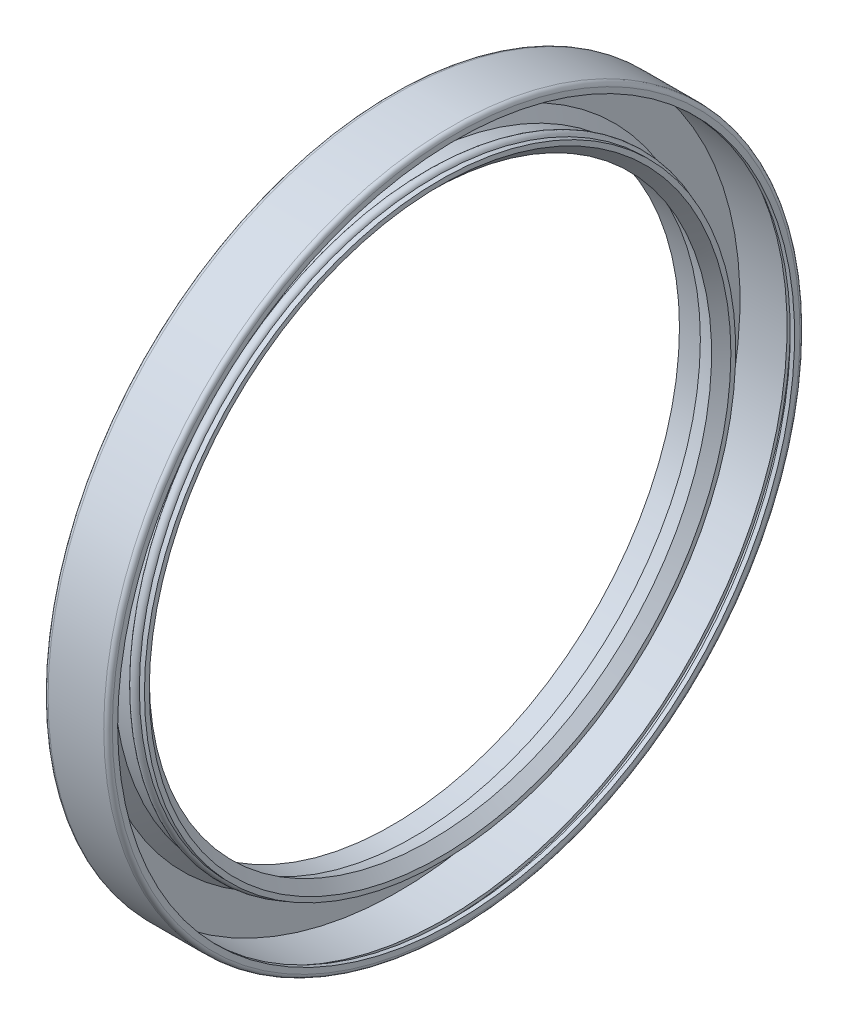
ISO-10303-21;
HEADER;
FILE_DESCRIPTION(('STEP AP214'),'2;1');
FILE_NAME('part.step','',(''),(''),'','','');
FILE_SCHEMA(('AUTOMOTIVE_DESIGN { 1 0 10303 214 1 1 1 1 }'));
ENDSEC;
DATA;
#1=APPLICATION_CONTEXT('core data for automotive mechanical design processes');
#2=APPLICATION_PROTOCOL_DEFINITION('international standard','automotive_design',2000,#1);
#3=PRODUCT_CONTEXT('',#1,'mechanical');
#4=PRODUCT('Part','Part','',(#3));
#5=PRODUCT_RELATED_PRODUCT_CATEGORY('part','',(#4));
#6=PRODUCT_DEFINITION_FORMATION('','',#4);
#7=PRODUCT_DEFINITION_CONTEXT('part definition',#1,'design');
#8=PRODUCT_DEFINITION('design','',#6,#7);
#9=PRODUCT_DEFINITION_SHAPE('','',#8);
#10=(LENGTH_UNIT() NAMED_UNIT(*) SI_UNIT(.MILLI.,.METRE.));
#11=(NAMED_UNIT(*) PLANE_ANGLE_UNIT() SI_UNIT($,.RADIAN.));
#12=(NAMED_UNIT(*) SI_UNIT($,.STERADIAN.) SOLID_ANGLE_UNIT());
#13=UNCERTAINTY_MEASURE_WITH_UNIT(LENGTH_MEASURE(1.E-05),#10,'distance_accuracy_value','');
#14=(GEOMETRIC_REPRESENTATION_CONTEXT(3) GLOBAL_UNCERTAINTY_ASSIGNED_CONTEXT((#13)) GLOBAL_UNIT_ASSIGNED_CONTEXT((#10,
#11,#12)) REPRESENTATION_CONTEXT('',''));
#15=CARTESIAN_POINT('',(0.,0.,0.));
#16=DIRECTION('',(0.,0.,1.));
#17=DIRECTION('',(1.,0.,0.));
#18=AXIS2_PLACEMENT_3D('',#15,#16,#17);
#19=CARTESIAN_POINT('',(0.,0.,-53.7));
#20=DIRECTION('',(1.,0.,0.));
#21=DIRECTION('',(0.,0.,-1.));
#22=AXIS2_PLACEMENT_3D('',#19,#20,#21);
#23=PLANE('',#22);
#24=CARTESIAN_POINT('',(0.,0.,0.));
#25=DIRECTION('',(-1.,0.,0.));
#26=DIRECTION('',(0.,0.,1.));
#27=AXIS2_PLACEMENT_3D('',#24,#25,#26);
#28=CIRCLE('',#27,64.2);
#29=CARTESIAN_POINT('',(0.,0.,64.2));
#30=VERTEX_POINT('',#29);
#31=EDGE_CURVE('E69',#30,#30,#28,.T.);
#32=ORIENTED_EDGE('',*,*,#31,.T.);
#33=EDGE_LOOP('',(#32));
#34=FACE_BOUND('',#33,.T.);
#35=CARTESIAN_POINT('',(0.,0.,0.));
#36=DIRECTION('',(1.,0.,0.));
#37=DIRECTION('',(0.,0.,-1.));
#38=AXIS2_PLACEMENT_3D('',#35,#36,#37);
#39=CIRCLE('',#38,54.3);
#40=CARTESIAN_POINT('',(0.,0.,-54.3));
#41=VERTEX_POINT('',#40);
#42=EDGE_CURVE('E10',#41,#41,#39,.F.);
#43=ORIENTED_EDGE('',*,*,#42,.F.);
#44=EDGE_LOOP('',(#43));
#45=FACE_BOUND('',#44,.T.);
#46=ADVANCED_FACE('F31',(#34,#45),#23,.F.);
#47=CARTESIAN_POINT('',(0.,0.,0.));
#48=DIRECTION('',(-1.,0.,0.));
#49=DIRECTION('',(0.,0.,1.));
#50=AXIS2_PLACEMENT_3D('',#47,#48,#49);
#51=CYLINDRICAL_SURFACE('',#50,63.8);
#52=CARTESIAN_POINT('',(10.,0.,0.));
#53=DIRECTION('',(-1.,0.,0.));
#54=DIRECTION('',(0.,0.,1.));
#55=AXIS2_PLACEMENT_3D('',#52,#53,#54);
#56=CIRCLE('',#55,63.8);
#57=CARTESIAN_POINT('',(10.,0.,63.8));
#58=VERTEX_POINT('',#57);
#59=EDGE_CURVE('E39',#58,#58,#56,.T.);
#60=ORIENTED_EDGE('',*,*,#59,.F.);
#61=EDGE_LOOP('',(#60));
#62=FACE_BOUND('',#61,.T.);
#63=CARTESIAN_POINT('',(1.2,0.,0.));
#64=DIRECTION('',(-1.,0.,0.));
#65=DIRECTION('',(0.,0.,1.));
#66=AXIS2_PLACEMENT_3D('',#63,#64,#65);
#67=CIRCLE('',#66,63.8);
#68=CARTESIAN_POINT('',(1.2,0.,63.8));
#69=VERTEX_POINT('',#68);
#70=EDGE_CURVE('E99',#69,#69,#67,.T.);
#71=ORIENTED_EDGE('',*,*,#70,.T.);
#72=EDGE_LOOP('',(#71));
#73=FACE_BOUND('',#72,.T.);
#74=ADVANCED_FACE('F33',(#62,#73),#51,.F.);
#75=CARTESIAN_POINT('',(10.,0.,-63.8));
#76=DIRECTION('',(-1.,0.,0.));
#77=DIRECTION('',(0.,0.,1.));
#78=AXIS2_PLACEMENT_3D('',#75,#76,#77);
#79=PLANE('',#78);
#80=CARTESIAN_POINT('',(10.,0.,0.));
#81=DIRECTION('',(-1.,0.,0.));
#82=DIRECTION('',(0.,0.,1.));
#83=AXIS2_PLACEMENT_3D('',#80,#81,#82);
#84=CIRCLE('',#83,64.4);
#85=CARTESIAN_POINT('',(10.,0.,64.4));
#86=VERTEX_POINT('',#85);
#87=EDGE_CURVE('E45',#86,#86,#84,.T.);
#88=ORIENTED_EDGE('',*,*,#87,.F.);
#89=EDGE_LOOP('',(#88));
#90=FACE_BOUND('',#89,.T.);
#91=ORIENTED_EDGE('',*,*,#59,.T.);
#92=EDGE_LOOP('',(#91));
#93=FACE_BOUND('',#92,.T.);
#94=ADVANCED_FACE('F173',(#90,#93),#79,.F.);
#95=CARTESIAN_POINT('',(0.,0.,0.));
#96=DIRECTION('',(-1.,0.,0.));
#97=DIRECTION('',(0.,0.,1.));
#98=AXIS2_PLACEMENT_3D('',#95,#96,#97);
#99=CYLINDRICAL_SURFACE('',#98,64.4);
#100=CARTESIAN_POINT('',(11.2,0.,0.));
#101=DIRECTION('',(-1.,0.,0.));
#102=DIRECTION('',(0.,0.,1.));
#103=AXIS2_PLACEMENT_3D('',#100,#101,#102);
#104=CIRCLE('',#103,64.4);
#105=CARTESIAN_POINT('',(11.2,0.,64.4));
#106=VERTEX_POINT('',#105);
#107=EDGE_CURVE('E49',#106,#106,#104,.T.);
#108=ORIENTED_EDGE('',*,*,#107,.F.);
#109=EDGE_LOOP('',(#108));
#110=FACE_BOUND('',#109,.T.);
#111=ORIENTED_EDGE('',*,*,#87,.T.);
#112=EDGE_LOOP('',(#111));
#113=FACE_BOUND('',#112,.T.);
#114=ADVANCED_FACE('F206',(#110,#113),#99,.F.);
#115=CARTESIAN_POINT('',(11.2,0.,-64.4));
#116=DIRECTION('',(1.,0.,0.));
#117=DIRECTION('',(0.,0.,-1.));
#118=AXIS2_PLACEMENT_3D('',#115,#116,#117);
#119=PLANE('',#118);
#120=CARTESIAN_POINT('',(11.2,0.,0.));
#121=DIRECTION('',(-1.,0.,0.));
#122=DIRECTION('',(0.,0.,1.));
#123=AXIS2_PLACEMENT_3D('',#120,#121,#122);
#124=CIRCLE('',#123,63.2);
#125=CARTESIAN_POINT('',(11.2,0.,63.2));
#126=VERTEX_POINT('',#125);
#127=EDGE_CURVE('E54',#126,#126,#124,.T.);
#128=ORIENTED_EDGE('',*,*,#127,.F.);
#129=EDGE_LOOP('',(#128));
#130=FACE_BOUND('',#129,.T.);
#131=ORIENTED_EDGE('',*,*,#107,.T.);
#132=EDGE_LOOP('',(#131));
#133=FACE_BOUND('',#132,.T.);
#134=ADVANCED_FACE('F200',(#130,#133),#119,.F.);
#135=CARTESIAN_POINT('',(0.,0.,0.));
#136=DIRECTION('',(-1.,0.,0.));
#137=DIRECTION('',(0.,0.,1.));
#138=AXIS2_PLACEMENT_3D('',#135,#136,#137);
#139=CYLINDRICAL_SURFACE('',#138,63.2);
#140=CARTESIAN_POINT('',(12.,0.,0.));
#141=DIRECTION('',(-1.,0.,0.));
#142=DIRECTION('',(0.,0.,1.));
#143=AXIS2_PLACEMENT_3D('',#140,#141,#142);
#144=CIRCLE('',#143,63.2);
#145=CARTESIAN_POINT('',(12.,0.,63.2));
#146=VERTEX_POINT('',#145);
#147=EDGE_CURVE('E57',#146,#146,#144,.T.);
#148=ORIENTED_EDGE('',*,*,#147,.F.);
#149=EDGE_LOOP('',(#148));
#150=FACE_BOUND('',#149,.T.);
#151=ORIENTED_EDGE('',*,*,#127,.T.);
#152=EDGE_LOOP('',(#151));
#153=FACE_BOUND('',#152,.T.);
#154=ADVANCED_FACE('F194',(#150,#153),#139,.F.);
#155=CARTESIAN_POINT('',(12.,0.,-63.2));
#156=DIRECTION('',(-1.,0.,0.));
#157=DIRECTION('',(0.,0.,1.));
#158=AXIS2_PLACEMENT_3D('',#155,#156,#157);
#159=PLANE('',#158);
#160=CARTESIAN_POINT('',(12.,0.,0.));
#161=DIRECTION('',(-1.,0.,0.));
#162=DIRECTION('',(0.,0.,1.));
#163=AXIS2_PLACEMENT_3D('',#160,#161,#162);
#164=CIRCLE('',#163,64.2);
#165=CARTESIAN_POINT('',(12.,0.,64.2));
#166=VERTEX_POINT('',#165);
#167=EDGE_CURVE('E60',#166,#166,#164,.T.);
#168=ORIENTED_EDGE('',*,*,#167,.F.);
#169=EDGE_LOOP('',(#168));
#170=FACE_BOUND('',#169,.T.);
#171=ORIENTED_EDGE('',*,*,#147,.T.);
#172=EDGE_LOOP('',(#171));
#173=FACE_BOUND('',#172,.T.);
#174=ADVANCED_FACE('F188',(#170,#173),#159,.F.);
#175=CARTESIAN_POINT('',(11.2,0.,0.));
#176=DIRECTION('',(-1.,0.,0.));
#177=DIRECTION('',(0.,0.,1.));
#178=AXIS2_PLACEMENT_3D('',#175,#176,#177);
#179=TOROIDAL_SURFACE('',#178,64.2,0.800000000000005);
#180=CARTESIAN_POINT('',(11.2,0.,0.));
#181=DIRECTION('',(-1.,0.,0.));
#182=DIRECTION('',(0.,0.,1.));
#183=AXIS2_PLACEMENT_3D('',#180,#181,#182);
#184=CIRCLE('',#183,65.);
#185=CARTESIAN_POINT('',(11.2,0.,65.));
#186=VERTEX_POINT('',#185);
#187=EDGE_CURVE('E63',#186,#186,#184,.T.);
#188=ORIENTED_EDGE('',*,*,#187,.F.);
#189=EDGE_LOOP('',(#188));
#190=FACE_BOUND('',#189,.T.);
#191=ORIENTED_EDGE('',*,*,#167,.T.);
#192=EDGE_LOOP('',(#191));
#193=FACE_BOUND('',#192,.T.);
#194=ADVANCED_FACE('F182',(#190,#193),#179,.T.);
#195=CARTESIAN_POINT('',(0.,0.,0.));
#196=DIRECTION('',(-1.,0.,0.));
#197=DIRECTION('',(0.,0.,1.));
#198=AXIS2_PLACEMENT_3D('',#195,#196,#197);
#199=CYLINDRICAL_SURFACE('',#198,65.);
#200=CARTESIAN_POINT('',(0.8,0.,0.));
#201=DIRECTION('',(-1.,0.,0.));
#202=DIRECTION('',(0.,0.,1.));
#203=AXIS2_PLACEMENT_3D('',#200,#201,#202);
#204=CIRCLE('',#203,65.);
#205=CARTESIAN_POINT('',(0.8,0.,65.));
#206=VERTEX_POINT('',#205);
#207=EDGE_CURVE('E66',#206,#206,#204,.T.);
#208=ORIENTED_EDGE('',*,*,#207,.F.);
#209=EDGE_LOOP('',(#208));
#210=FACE_BOUND('',#209,.T.);
#211=ORIENTED_EDGE('',*,*,#187,.T.);
#212=EDGE_LOOP('',(#211));
#213=FACE_BOUND('',#212,.T.);
#214=ADVANCED_FACE('F165',(#210,#213),#199,.T.);
#215=CARTESIAN_POINT('',(0.8,0.,0.));
#216=DIRECTION('',(-1.,0.,0.));
#217=DIRECTION('',(0.,0.,1.));
#218=AXIS2_PLACEMENT_3D('',#215,#216,#217);
#219=TOROIDAL_SURFACE('',#218,64.2,0.799999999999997);
#220=ORIENTED_EDGE('',*,*,#31,.F.);
#221=EDGE_LOOP('',(#220));
#222=FACE_BOUND('',#221,.T.);
#223=ORIENTED_EDGE('',*,*,#207,.T.);
#224=EDGE_LOOP('',(#223));
#225=FACE_BOUND('',#224,.T.);
#226=ADVANCED_FACE('F160',(#222,#225),#219,.T.);
#227=ORIENTED_EDGE('',*,*,#42,.T.);
#228=EDGE_LOOP('',(#227));
#229=FACE_BOUND('',#228,.T.);
#230=CARTESIAN_POINT('',(0.,0.,0.));
#231=DIRECTION('',(-1.,0.,0.));
#232=DIRECTION('',(0.,0.,1.));
#233=AXIS2_PLACEMENT_3D('',#230,#231,#232);
#234=CIRCLE('',#233,53.7);
#235=CARTESIAN_POINT('',(0.,0.,53.7));
#236=VERTEX_POINT('',#235);
#237=EDGE_CURVE('E72',#236,#236,#234,.T.);
#238=ORIENTED_EDGE('',*,*,#237,.F.);
#239=EDGE_LOOP('',(#238));
#240=FACE_BOUND('',#239,.T.);
#241=ADVANCED_FACE('F155',(#229,#240),#23,.F.);
#242=CARTESIAN_POINT('',(0.,0.,0.));
#243=DIRECTION('',(-1.,0.,0.));
#244=DIRECTION('',(0.,0.,1.));
#245=AXIS2_PLACEMENT_3D('',#242,#243,#244);
#246=CYLINDRICAL_SURFACE('',#245,53.7);
#247=CARTESIAN_POINT('',(3.90302709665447,0.,0.));
#248=DIRECTION('',(-1.,0.,0.));
#249=DIRECTION('',(0.,0.,1.));
#250=AXIS2_PLACEMENT_3D('',#247,#248,#249);
#251=CIRCLE('',#250,53.7);
#252=CARTESIAN_POINT('',(3.90302709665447,0.,53.7));
#253=VERTEX_POINT('',#252);
#254=EDGE_CURVE('E75',#253,#253,#251,.T.);
#255=ORIENTED_EDGE('',*,*,#254,.F.);
#256=EDGE_LOOP('',(#255));
#257=FACE_BOUND('',#256,.T.);
#258=ORIENTED_EDGE('',*,*,#237,.T.);
#259=EDGE_LOOP('',(#258));
#260=FACE_BOUND('',#259,.T.);
#261=ADVANCED_FACE('F149',(#257,#260),#246,.F.);
#262=CARTESIAN_POINT('',(3.90302709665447,0.,0.));
#263=DIRECTION('',(-1.,0.,0.));
#264=DIRECTION('',(0.,0.,1.));
#265=AXIS2_PLACEMENT_3D('',#262,#263,#264);
#266=CONICAL_SURFACE('',#265,53.7,0.349065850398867);
#267=CARTESIAN_POINT('',(7.2,0.,0.));
#268=DIRECTION('',(-1.,0.,0.));
#269=DIRECTION('',(0.,0.,1.));
#270=AXIS2_PLACEMENT_3D('',#267,#268,#269);
#271=CIRCLE('',#270,52.5);
#272=CARTESIAN_POINT('',(7.2,0.,52.5));
#273=VERTEX_POINT('',#272);
#274=EDGE_CURVE('E78',#273,#273,#271,.T.);
#275=ORIENTED_EDGE('',*,*,#274,.F.);
#276=EDGE_LOOP('',(#275));
#277=FACE_BOUND('',#276,.T.);
#278=ORIENTED_EDGE('',*,*,#254,.T.);
#279=EDGE_LOOP('',(#278));
#280=FACE_BOUND('',#279,.T.);
#281=ADVANCED_FACE('F143',(#277,#280),#266,.F.);
#282=CARTESIAN_POINT('',(7.2,0.,0.));
#283=DIRECTION('',(1.,0.,0.));
#284=DIRECTION('',(0.,0.,-1.));
#285=AXIS2_PLACEMENT_3D('',#282,#283,#284);
#286=CONICAL_SURFACE('',#285,52.5,0.785398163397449);
#287=CARTESIAN_POINT('',(9.,0.,0.));
#288=DIRECTION('',(-1.,0.,0.));
#289=DIRECTION('',(0.,0.,1.));
#290=AXIS2_PLACEMENT_3D('',#287,#288,#289);
#291=CIRCLE('',#290,54.3);
#292=CARTESIAN_POINT('',(9.,0.,54.3));
#293=VERTEX_POINT('',#292);
#294=EDGE_CURVE('E81',#293,#293,#291,.T.);
#295=ORIENTED_EDGE('',*,*,#294,.F.);
#296=EDGE_LOOP('',(#295));
#297=FACE_BOUND('',#296,.T.);
#298=ORIENTED_EDGE('',*,*,#274,.T.);
#299=EDGE_LOOP('',(#298));
#300=FACE_BOUND('',#299,.T.);
#301=ADVANCED_FACE('F137',(#297,#300),#286,.F.);
#302=CARTESIAN_POINT('',(9.,0.,-54.3));
#303=DIRECTION('',(-1.,0.,0.));
#304=DIRECTION('',(0.,0.,1.));
#305=AXIS2_PLACEMENT_3D('',#302,#303,#304);
#306=PLANE('',#305);
#307=CARTESIAN_POINT('',(9.,0.,0.));
#308=DIRECTION('',(-1.,0.,0.));
#309=DIRECTION('',(0.,0.,1.));
#310=AXIS2_PLACEMENT_3D('',#307,#308,#309);
#311=CIRCLE('',#310,55.2);
#312=CARTESIAN_POINT('',(9.,0.,55.2));
#313=VERTEX_POINT('',#312);
#314=EDGE_CURVE('E84',#313,#313,#311,.T.);
#315=ORIENTED_EDGE('',*,*,#314,.F.);
#316=EDGE_LOOP('',(#315));
#317=FACE_BOUND('',#316,.T.);
#318=ORIENTED_EDGE('',*,*,#294,.T.);
#319=EDGE_LOOP('',(#318));
#320=FACE_BOUND('',#319,.T.);
#321=ADVANCED_FACE('F131',(#317,#320),#306,.F.);
#322=CARTESIAN_POINT('',(0.,0.,0.));
#323=DIRECTION('',(-1.,0.,0.));
#324=DIRECTION('',(0.,0.,1.));
#325=AXIS2_PLACEMENT_3D('',#322,#323,#324);
#326=CYLINDRICAL_SURFACE('',#325,55.2);
#327=CARTESIAN_POINT('',(8.04852813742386,0.,0.));
#328=DIRECTION('',(-1.,0.,0.));
#329=DIRECTION('',(0.,0.,1.));
#330=AXIS2_PLACEMENT_3D('',#327,#328,#329);
#331=CIRCLE('',#330,55.2);
#332=CARTESIAN_POINT('',(8.04852813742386,0.,55.2));
#333=VERTEX_POINT('',#332);
#334=EDGE_CURVE('E87',#333,#333,#331,.T.);
#335=ORIENTED_EDGE('',*,*,#334,.F.);
#336=EDGE_LOOP('',(#335));
#337=FACE_BOUND('',#336,.T.);
#338=ORIENTED_EDGE('',*,*,#314,.T.);
#339=EDGE_LOOP('',(#338));
#340=FACE_BOUND('',#339,.T.);
#341=ADVANCED_FACE('F125',(#337,#340),#326,.T.);
#342=CARTESIAN_POINT('',(7.2,0.,0.));
#343=DIRECTION('',(-1.,0.,0.));
#344=DIRECTION('',(0.,0.,1.));
#345=AXIS2_PLACEMENT_3D('',#342,#343,#344);
#346=TOROIDAL_SURFACE('',#345,54.9,0.9);
#347=CARTESIAN_POINT('',(6.3,0.,0.));
#348=DIRECTION('',(-1.,0.,0.));
#349=DIRECTION('',(0.,0.,1.));
#350=AXIS2_PLACEMENT_3D('',#347,#348,#349);
#351=CIRCLE('',#350,54.9);
#352=CARTESIAN_POINT('',(6.3,0.,54.9));
#353=VERTEX_POINT('',#352);
#354=EDGE_CURVE('E90',#353,#353,#351,.T.);
#355=ORIENTED_EDGE('',*,*,#354,.F.);
#356=EDGE_LOOP('',(#355));
#357=FACE_BOUND('',#356,.T.);
#358=ORIENTED_EDGE('',*,*,#334,.T.);
#359=EDGE_LOOP('',(#358));
#360=FACE_BOUND('',#359,.T.);
#361=ADVANCED_FACE('F119',(#357,#360),#346,.T.);
#362=CARTESIAN_POINT('',(0.,0.,0.));
#363=DIRECTION('',(-1.,0.,0.));
#364=DIRECTION('',(0.,0.,1.));
#365=AXIS2_PLACEMENT_3D('',#362,#363,#364);
#366=CYLINDRICAL_SURFACE('',#365,54.9);
#367=CARTESIAN_POINT('',(3.,0.,0.));
#368=DIRECTION('',(-1.,0.,0.));
#369=DIRECTION('',(0.,0.,1.));
#370=AXIS2_PLACEMENT_3D('',#367,#368,#369);
#371=CIRCLE('',#370,54.9);
#372=CARTESIAN_POINT('',(3.,0.,54.9));
#373=VERTEX_POINT('',#372);
#374=EDGE_CURVE('E93',#373,#373,#371,.T.);
#375=ORIENTED_EDGE('',*,*,#374,.F.);
#376=EDGE_LOOP('',(#375));
#377=FACE_BOUND('',#376,.T.);
#378=ORIENTED_EDGE('',*,*,#354,.T.);
#379=EDGE_LOOP('',(#378));
#380=FACE_BOUND('',#379,.T.);
#381=ADVANCED_FACE('F113',(#377,#380),#366,.T.);
#382=CARTESIAN_POINT('',(3.,0.,0.));
#383=DIRECTION('',(-1.,0.,0.));
#384=DIRECTION('',(0.,0.,1.));
#385=AXIS2_PLACEMENT_3D('',#382,#383,#384);
#386=CONICAL_SURFACE('',#385,54.9,0.872664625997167);
#387=CARTESIAN_POINT('',(1.2,0.,0.));
#388=DIRECTION('',(-1.,0.,0.));
#389=DIRECTION('',(0.,0.,1.));
#390=AXIS2_PLACEMENT_3D('',#387,#388,#389);
#391=CIRCLE('',#390,57.0451564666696);
#392=CARTESIAN_POINT('',(1.2,0.,57.0451564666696));
#393=VERTEX_POINT('',#392);
#394=EDGE_CURVE('E96',#393,#393,#391,.T.);
#395=ORIENTED_EDGE('',*,*,#394,.F.);
#396=EDGE_LOOP('',(#395));
#397=FACE_BOUND('',#396,.T.);
#398=ORIENTED_EDGE('',*,*,#374,.T.);
#399=EDGE_LOOP('',(#398));
#400=FACE_BOUND('',#399,.T.);
#401=ADVANCED_FACE('F107',(#397,#400),#386,.T.);
#402=CARTESIAN_POINT('',(1.2,0.,-63.8));
#403=DIRECTION('',(-1.,0.,0.));
#404=DIRECTION('',(0.,0.,1.));
#405=AXIS2_PLACEMENT_3D('',#402,#403,#404);
#406=PLANE('',#405);
#407=ORIENTED_EDGE('',*,*,#70,.F.);
#408=EDGE_LOOP('',(#407));
#409=FACE_BOUND('',#408,.T.);
#410=ORIENTED_EDGE('',*,*,#394,.T.);
#411=EDGE_LOOP('',(#410));
#412=FACE_BOUND('',#411,.T.);
#413=ADVANCED_FACE('F104',(#409,#412),#406,.F.);
#414=CLOSED_SHELL('',(#46,#74,#94,#114,#134,#154,#174,#194,#214,#226,#241,#261,#281,#301,#321,
#341,#361,#381,#401,#413));
#415=MANIFOLD_SOLID_BREP('B2',#414);
#416=ADVANCED_BREP_SHAPE_REPRESENTATION('',(#18,#415),#14);
#417=SHAPE_DEFINITION_REPRESENTATION(#9,#416);
ENDSEC;
END-ISO-10303-21;
